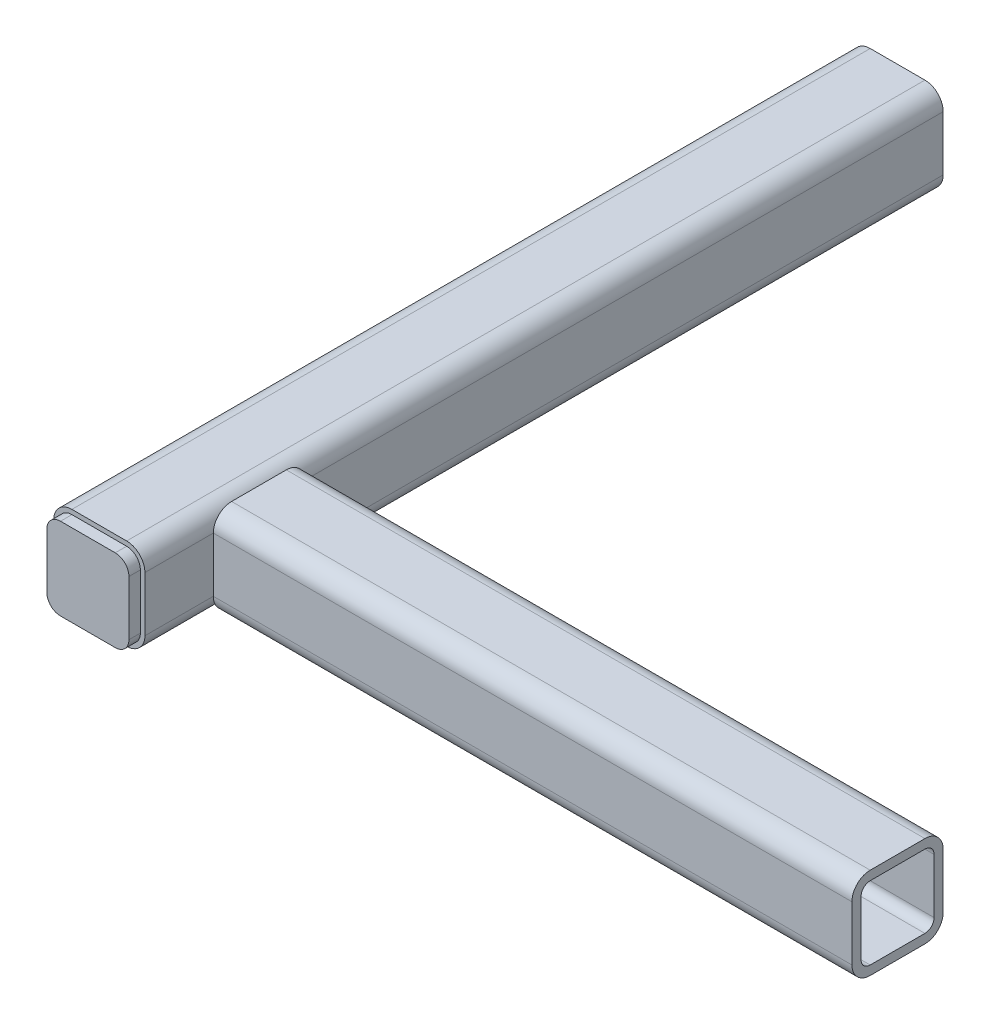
from build123d import *

# Parameters (mm, degrees)
SQUARE_TUBE_20_X_20_X_2_1_DEPTH   = 175
SQUARE_TUBE_20_X_20_X_2_1_2_DEPTH = 151
END_CAP1_INSET                    = 1
END_CAP1_THICKNESS                = 2.5


with BuildPart() as part:
    # Sketch13 → Square tube 20 X 20 X 2_1 (new body)
    with BuildSketch(Plane.XY.offset(-150)):
        with BuildLine():
            Line((-6, -10), (6, -10))
            ThreePointArc((6, -10), (8.828427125, -8.828427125), (10, -6))
            Line((10, -6), (10, 6))
            ThreePointArc((10, 6), (8.828427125, 8.828427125), (6, 10))
            Line((6, 10), (-6, 10))
            ThreePointArc((-6, 10), (-8.828427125, 8.828427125), (-10, 6))
            Line((-10, 6), (-10, -6))
            ThreePointArc((-10, -6), (-8.828427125, -8.828427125), (-6, -10))
        make_face()
        with BuildLine():
            Line((-6, -8), (6, -8))
            ThreePointArc((6, -8), (7.414213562, -7.414213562), (8, -6))
            Line((8, -6), (8, 6))
            ThreePointArc((8, 6), (7.414213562, 7.414213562), (6, 8))
            Line((6, 8), (-6, 8))
            ThreePointArc((-6, 8), (-7.414213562, 7.414213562), (-8, 6))
            Line((-8, 6), (-8, -6))
            ThreePointArc((-8, -6), (-7.414213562, -7.414213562), (-6, -8))
        make_face(mode=Mode.SUBTRACT)
    extrude(amount=SQUARE_TUBE_20_X_20_X_2_1_DEPTH)


with BuildPart() as body_2:
    # Sketch13 on segment 2 (on carried to segment 2) → Square tube 20 X 20 X 2_1 2 (new body)
    with BuildSketch(Plane(origin=(-1, 0, 0), x_dir=(0, 0, -1), z_dir=(1, 0, 0))):
        with BuildLine():
            Line((-6, -10), (6, -10))
            ThreePointArc((6, -10), (8.828427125, -8.828427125), (10, -6))
            Line((10, -6), (10, 6))
            ThreePointArc((10, 6), (8.828427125, 8.828427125), (6, 10))
            Line((6, 10), (-6, 10))
            ThreePointArc((-6, 10), (-8.828427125, 8.828427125), (-10, 6))
            Line((-10, 6), (-10, -6))
            ThreePointArc((-10, -6), (-8.828427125, -8.828427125), (-6, -10))
        make_face()
        with BuildLine():
            Line((-6, -8), (6, -8))
            ThreePointArc((6, -8), (7.414213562, -7.414213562), (8, -6))
            Line((8, -6), (8, 6))
            ThreePointArc((8, 6), (7.414213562, 7.414213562), (6, 8))
            Line((6, 8), (-6, 8))
            ThreePointArc((-6, 8), (-7.414213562, 7.414213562), (-8, 6))
            Line((-8, 6), (-8, -6))
            ThreePointArc((-8, -6), (-7.414213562, -7.414213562), (-6, -8))
        make_face(mode=Mode.SUBTRACT)
    extrude(amount=SQUARE_TUBE_20_X_20_X_2_1_2_DEPTH)

    # Square tube 20 X 20 X 2_1 2 end butt 1
    split(bisect_by=Plane.YZ.offset(10), keep=Keep.TOP)


with BuildPart() as body_3:
    # End cap1: an end cap: a plate 2.5 thick on the member's open end, its outline the end's outer outline set in by 1.0
    end_cap1_end = part.part.faces().sort_by_distance((-8, -8, 25))[0]
    add(extrude(Face(end_cap1_end.outer_wire().offset_2d(-END_CAP1_INSET)), amount=END_CAP1_THICKNESS, dir=(0, 0, 1)))


solid = Compound([part.part, body_2.part, body_3.part])
